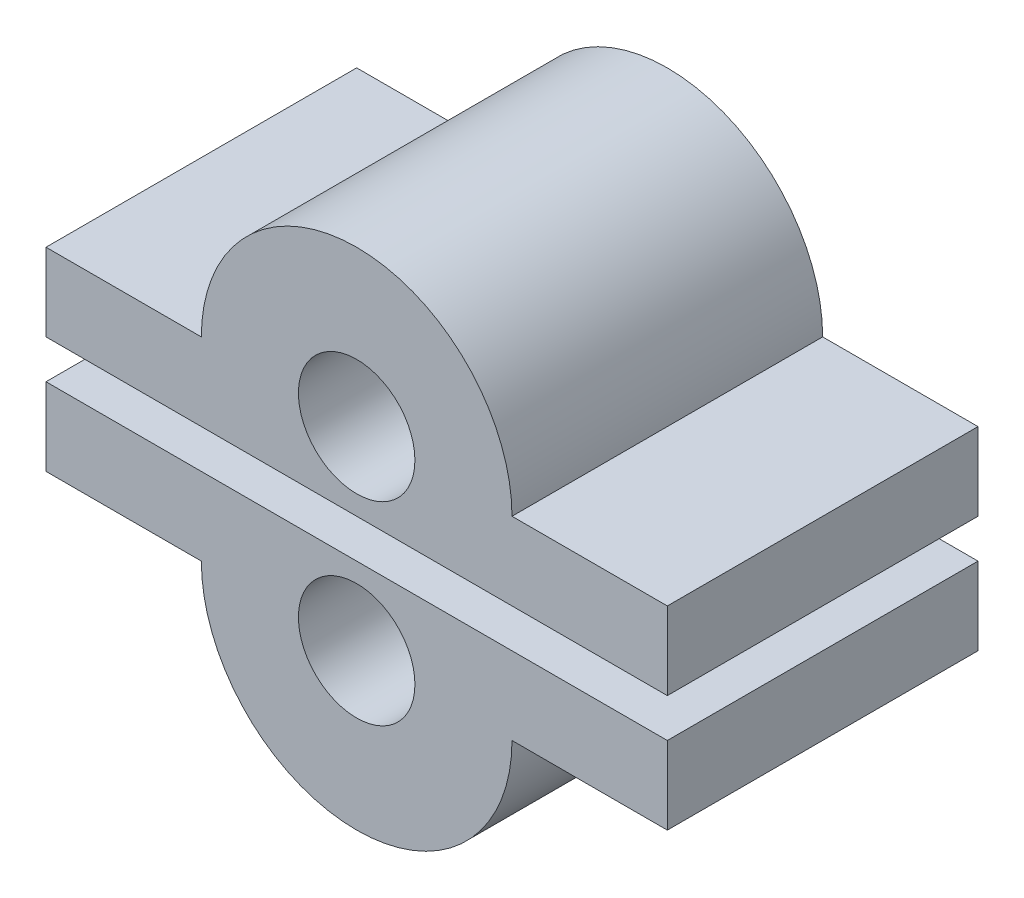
ISO-10303-21;
HEADER;
FILE_DESCRIPTION(('STEP AP214'),'2;1');
FILE_NAME('part.step','',(''),(''),'','','');
FILE_SCHEMA(('AUTOMOTIVE_DESIGN { 1 0 10303 214 1 1 1 1 }'));
ENDSEC;
DATA;
#1=APPLICATION_CONTEXT('core data for automotive mechanical design processes');
#2=APPLICATION_PROTOCOL_DEFINITION('international standard','automotive_design',2000,#1);
#3=PRODUCT_CONTEXT('',#1,'mechanical');
#4=PRODUCT('Part','Part','',(#3));
#5=PRODUCT_RELATED_PRODUCT_CATEGORY('part','',(#4));
#6=PRODUCT_DEFINITION_FORMATION('','',#4);
#7=PRODUCT_DEFINITION_CONTEXT('part definition',#1,'design');
#8=PRODUCT_DEFINITION('design','',#6,#7);
#9=PRODUCT_DEFINITION_SHAPE('','',#8);
#10=(LENGTH_UNIT() NAMED_UNIT(*) SI_UNIT(.MILLI.,.METRE.));
#11=(NAMED_UNIT(*) PLANE_ANGLE_UNIT() SI_UNIT($,.RADIAN.));
#12=(NAMED_UNIT(*) SI_UNIT($,.STERADIAN.) SOLID_ANGLE_UNIT());
#13=UNCERTAINTY_MEASURE_WITH_UNIT(LENGTH_MEASURE(1.E-05),#10,'distance_accuracy_value','');
#14=(GEOMETRIC_REPRESENTATION_CONTEXT(3) GLOBAL_UNCERTAINTY_ASSIGNED_CONTEXT((#13)) GLOBAL_UNIT_ASSIGNED_CONTEXT((#10,
#11,#12)) REPRESENTATION_CONTEXT('',''));
#15=CARTESIAN_POINT('',(0.,0.,0.));
#16=DIRECTION('',(0.,0.,1.));
#17=DIRECTION('',(1.,0.,0.));
#18=AXIS2_PLACEMENT_3D('',#15,#16,#17);
#19=CARTESIAN_POINT('',(40.,12.5,20.));
#20=DIRECTION('',(0.,0.,1.));
#21=DIRECTION('',(1.,0.,0.));
#22=AXIS2_PLACEMENT_3D('',#19,#20,#21);
#23=PLANE('',#22);
#24=DIRECTION('',(1.,0.,0.));
#25=VECTOR('',#24,1.);
#26=CARTESIAN_POINT('',(0.,-2.5,20.));
#27=LINE('',#26,#25);
#28=CARTESIAN_POINT('',(0.,-2.5,20.));
#29=VERTEX_POINT('',#28);
#30=CARTESIAN_POINT('',(80.,-2.5,20.));
#31=VERTEX_POINT('',#30);
#32=EDGE_CURVE('E51',#29,#31,#27,.T.);
#33=ORIENTED_EDGE('',*,*,#32,.F.);
#34=DIRECTION('',(0.,-1.,0.));
#35=VECTOR('',#34,1.);
#36=CARTESIAN_POINT('',(0.,12.5,20.));
#37=LINE('',#36,#35);
#38=CARTESIAN_POINT('',(0.,-12.5,20.));
#39=VERTEX_POINT('',#38);
#40=EDGE_CURVE('E120',#29,#39,#37,.T.);
#41=ORIENTED_EDGE('',*,*,#40,.T.);
#42=DIRECTION('',(1.,0.,0.));
#43=VECTOR('',#42,1.);
#44=CARTESIAN_POINT('',(20.,-12.5,20.));
#45=LINE('',#44,#43);
#46=CARTESIAN_POINT('',(20.,-12.5,20.));
#47=VERTEX_POINT('',#46);
#48=EDGE_CURVE('E121',#39,#47,#45,.T.);
#49=ORIENTED_EDGE('',*,*,#48,.T.);
#50=CARTESIAN_POINT('',(40.,-12.5,20.));
#51=DIRECTION('',(0.,0.,1.));
#52=DIRECTION('',(-1.,0.,0.));
#53=AXIS2_PLACEMENT_3D('',#50,#51,#52);
#54=CIRCLE('',#53,20.);
#55=CARTESIAN_POINT('',(60.,-12.5,20.));
#56=VERTEX_POINT('',#55);
#57=EDGE_CURVE('E116',#47,#56,#54,.T.);
#58=ORIENTED_EDGE('',*,*,#57,.T.);
#59=DIRECTION('',(1.,0.,0.));
#60=VECTOR('',#59,1.);
#61=CARTESIAN_POINT('',(80.,-12.5,20.));
#62=LINE('',#61,#60);
#63=CARTESIAN_POINT('',(80.,-12.5,20.));
#64=VERTEX_POINT('',#63);
#65=EDGE_CURVE('E110',#56,#64,#62,.T.);
#66=ORIENTED_EDGE('',*,*,#65,.T.);
#67=DIRECTION('',(0.,1.,0.));
#68=VECTOR('',#67,1.);
#69=CARTESIAN_POINT('',(80.,-12.5,20.));
#70=LINE('',#69,#68);
#71=EDGE_CURVE('E103',#64,#31,#70,.T.);
#72=ORIENTED_EDGE('',*,*,#71,.T.);
#73=EDGE_LOOP('',(#33,#41,#49,#58,#66,#72));
#74=FACE_BOUND('',#73,.T.);
#75=CARTESIAN_POINT('',(40.,-12.5,20.));
#76=DIRECTION('',(0.,0.,1.));
#77=DIRECTION('',(1.,0.,0.));
#78=AXIS2_PLACEMENT_3D('',#75,#76,#77);
#79=CIRCLE('',#78,7.5);
#80=CARTESIAN_POINT('',(47.5,-12.5,20.));
#81=VERTEX_POINT('',#80);
#82=EDGE_CURVE('E96',#81,#81,#79,.T.);
#83=ORIENTED_EDGE('',*,*,#82,.F.);
#84=EDGE_LOOP('',(#83));
#85=FACE_BOUND('',#84,.T.);
#86=ADVANCED_FACE('F43',(#74,#85),#23,.T.);
#87=CARTESIAN_POINT('',(40.,12.5,-20.));
#88=DIRECTION('',(0.,0.,1.));
#89=DIRECTION('',(1.,0.,0.));
#90=AXIS2_PLACEMENT_3D('',#87,#88,#89);
#91=PLANE('',#90);
#92=CARTESIAN_POINT('',(40.,-12.5,-20.));
#93=DIRECTION('',(0.,0.,1.));
#94=DIRECTION('',(1.,0.,0.));
#95=AXIS2_PLACEMENT_3D('',#92,#93,#94);
#96=CIRCLE('',#95,7.5);
#97=CARTESIAN_POINT('',(47.5,-12.5,-20.));
#98=VERTEX_POINT('',#97);
#99=EDGE_CURVE('E112',#98,#98,#96,.T.);
#100=ORIENTED_EDGE('',*,*,#99,.T.);
#101=EDGE_LOOP('',(#100));
#102=FACE_BOUND('',#101,.T.);
#103=DIRECTION('',(0.,-1.,0.));
#104=VECTOR('',#103,1.);
#105=CARTESIAN_POINT('',(0.,12.5,-20.));
#106=LINE('',#105,#104);
#107=CARTESIAN_POINT('',(0.,-2.5,-20.));
#108=VERTEX_POINT('',#107);
#109=CARTESIAN_POINT('',(0.,-12.5,-20.));
#110=VERTEX_POINT('',#109);
#111=EDGE_CURVE('E46',#108,#110,#106,.T.);
#112=ORIENTED_EDGE('',*,*,#111,.F.);
#113=DIRECTION('',(1.,0.,0.));
#114=VECTOR('',#113,1.);
#115=CARTESIAN_POINT('',(0.,-2.5,-20.));
#116=LINE('',#115,#114);
#117=CARTESIAN_POINT('',(80.,-2.5,-20.));
#118=VERTEX_POINT('',#117);
#119=EDGE_CURVE('E63',#108,#118,#116,.T.);
#120=ORIENTED_EDGE('',*,*,#119,.T.);
#121=DIRECTION('',(0.,1.,0.));
#122=VECTOR('',#121,1.);
#123=CARTESIAN_POINT('',(80.,-12.5,-20.));
#124=LINE('',#123,#122);
#125=CARTESIAN_POINT('',(80.,-12.5,-20.));
#126=VERTEX_POINT('',#125);
#127=EDGE_CURVE('E105',#126,#118,#124,.T.);
#128=ORIENTED_EDGE('',*,*,#127,.F.);
#129=DIRECTION('',(1.,0.,0.));
#130=VECTOR('',#129,1.);
#131=CARTESIAN_POINT('',(80.,-12.5,-20.));
#132=LINE('',#131,#130);
#133=CARTESIAN_POINT('',(60.,-12.5,-20.));
#134=VERTEX_POINT('',#133);
#135=EDGE_CURVE('E137',#134,#126,#132,.T.);
#136=ORIENTED_EDGE('',*,*,#135,.F.);
#137=CARTESIAN_POINT('',(40.,-12.5,-20.));
#138=DIRECTION('',(0.,0.,1.));
#139=DIRECTION('',(-1.,0.,0.));
#140=AXIS2_PLACEMENT_3D('',#137,#138,#139);
#141=CIRCLE('',#140,20.);
#142=CARTESIAN_POINT('',(20.,-12.5,-20.));
#143=VERTEX_POINT('',#142);
#144=EDGE_CURVE('E134',#143,#134,#141,.T.);
#145=ORIENTED_EDGE('',*,*,#144,.F.);
#146=DIRECTION('',(1.,0.,0.));
#147=VECTOR('',#146,1.);
#148=CARTESIAN_POINT('',(20.,-12.5,-20.));
#149=LINE('',#148,#147);
#150=EDGE_CURVE('E131',#110,#143,#149,.T.);
#151=ORIENTED_EDGE('',*,*,#150,.F.);
#152=EDGE_LOOP('',(#112,#120,#128,#136,#145,#151));
#153=FACE_BOUND('',#152,.T.);
#154=ADVANCED_FACE('F152',(#102,#153),#91,.F.);
#155=CARTESIAN_POINT('',(0.,12.5,20.));
#156=DIRECTION('',(1.,0.,0.));
#157=DIRECTION('',(0.,0.,-1.));
#158=AXIS2_PLACEMENT_3D('',#155,#156,#157);
#159=PLANE('',#158);
#160=ORIENTED_EDGE('',*,*,#40,.F.);
#161=DIRECTION('',(0.,0.,1.));
#162=VECTOR('',#161,1.);
#163=CARTESIAN_POINT('',(0.,-2.5,-20.));
#164=LINE('',#163,#162);
#165=EDGE_CURVE('E12',#108,#29,#164,.T.);
#166=ORIENTED_EDGE('',*,*,#165,.F.);
#167=ORIENTED_EDGE('',*,*,#111,.T.);
#168=DIRECTION('',(0.,0.,-1.));
#169=VECTOR('',#168,1.);
#170=CARTESIAN_POINT('',(0.,-12.5,20.));
#171=LINE('',#170,#169);
#172=EDGE_CURVE('E133',#39,#110,#171,.T.);
#173=ORIENTED_EDGE('',*,*,#172,.F.);
#174=EDGE_LOOP('',(#160,#166,#167,#173));
#175=FACE_BOUND('',#174,.T.);
#176=ADVANCED_FACE('F174',(#175),#159,.F.);
#177=CARTESIAN_POINT('',(80.,-12.5,20.));
#178=DIRECTION('',(-1.,0.,0.));
#179=DIRECTION('',(0.,0.,1.));
#180=AXIS2_PLACEMENT_3D('',#177,#178,#179);
#181=PLANE('',#180);
#182=ORIENTED_EDGE('',*,*,#127,.T.);
#183=DIRECTION('',(0.,0.,1.));
#184=VECTOR('',#183,1.);
#185=CARTESIAN_POINT('',(80.,-2.5,-20.));
#186=LINE('',#185,#184);
#187=EDGE_CURVE('E92',#118,#31,#186,.T.);
#188=ORIENTED_EDGE('',*,*,#187,.T.);
#189=ORIENTED_EDGE('',*,*,#71,.F.);
#190=DIRECTION('',(0.,0.,-1.));
#191=VECTOR('',#190,1.);
#192=CARTESIAN_POINT('',(80.,-12.5,20.));
#193=LINE('',#192,#191);
#194=EDGE_CURVE('E106',#64,#126,#193,.T.);
#195=ORIENTED_EDGE('',*,*,#194,.T.);
#196=EDGE_LOOP('',(#182,#188,#189,#195));
#197=FACE_BOUND('',#196,.T.);
#198=ADVANCED_FACE('F101',(#197),#181,.F.);
#199=CARTESIAN_POINT('',(20.,-12.5,20.));
#200=DIRECTION('',(0.,1.,0.));
#201=DIRECTION('',(-1.,0.,0.));
#202=AXIS2_PLACEMENT_3D('',#199,#200,#201);
#203=PLANE('',#202);
#204=ORIENTED_EDGE('',*,*,#150,.T.);
#205=DIRECTION('',(0.,0.,-1.));
#206=VECTOR('',#205,1.);
#207=CARTESIAN_POINT('',(20.,-12.5,20.));
#208=LINE('',#207,#206);
#209=EDGE_CURVE('E136',#47,#143,#208,.T.);
#210=ORIENTED_EDGE('',*,*,#209,.F.);
#211=ORIENTED_EDGE('',*,*,#48,.F.);
#212=ORIENTED_EDGE('',*,*,#172,.T.);
#213=EDGE_LOOP('',(#204,#210,#211,#212));
#214=FACE_BOUND('',#213,.T.);
#215=ADVANCED_FACE('F149',(#214),#203,.F.);
#216=CARTESIAN_POINT('',(40.,-12.5,20.));
#217=DIRECTION('',(0.,0.,-1.));
#218=DIRECTION('',(-1.,0.,0.));
#219=AXIS2_PLACEMENT_3D('',#216,#217,#218);
#220=CYLINDRICAL_SURFACE('',#219,20.);
#221=ORIENTED_EDGE('',*,*,#144,.T.);
#222=DIRECTION('',(0.,0.,-1.));
#223=VECTOR('',#222,1.);
#224=CARTESIAN_POINT('',(60.,-12.5,20.));
#225=LINE('',#224,#223);
#226=EDGE_CURVE('E130',#56,#134,#225,.T.);
#227=ORIENTED_EDGE('',*,*,#226,.F.);
#228=ORIENTED_EDGE('',*,*,#57,.F.);
#229=ORIENTED_EDGE('',*,*,#209,.T.);
#230=EDGE_LOOP('',(#221,#227,#228,#229));
#231=FACE_BOUND('',#230,.T.);
#232=ADVANCED_FACE('F156',(#231),#220,.T.);
#233=CARTESIAN_POINT('',(80.,-12.5,20.));
#234=DIRECTION('',(0.,1.,0.));
#235=DIRECTION('',(0.,0.,1.));
#236=AXIS2_PLACEMENT_3D('',#233,#234,#235);
#237=PLANE('',#236);
#238=ORIENTED_EDGE('',*,*,#135,.T.);
#239=ORIENTED_EDGE('',*,*,#194,.F.);
#240=ORIENTED_EDGE('',*,*,#65,.F.);
#241=ORIENTED_EDGE('',*,*,#226,.T.);
#242=EDGE_LOOP('',(#238,#239,#240,#241));
#243=FACE_BOUND('',#242,.T.);
#244=ADVANCED_FACE('F159',(#243),#237,.F.);
#245=CARTESIAN_POINT('',(40.,-12.5,20.));
#246=DIRECTION('',(0.,0.,-1.));
#247=DIRECTION('',(-1.,0.,0.));
#248=AXIS2_PLACEMENT_3D('',#245,#246,#247);
#249=CYLINDRICAL_SURFACE('',#248,7.5);
#250=ORIENTED_EDGE('',*,*,#82,.T.);
#251=EDGE_LOOP('',(#250));
#252=FACE_BOUND('',#251,.T.);
#253=ORIENTED_EDGE('',*,*,#99,.F.);
#254=EDGE_LOOP('',(#253));
#255=FACE_BOUND('',#254,.T.);
#256=ADVANCED_FACE('F161',(#252,#255),#249,.F.);
#257=CARTESIAN_POINT('',(0.,-2.5,-20.));
#258=DIRECTION('',(0.,-1.,0.));
#259=DIRECTION('',(0.,0.,-1.));
#260=AXIS2_PLACEMENT_3D('',#257,#258,#259);
#261=PLANE('',#260);
#262=ORIENTED_EDGE('',*,*,#32,.T.);
#263=ORIENTED_EDGE('',*,*,#187,.F.);
#264=ORIENTED_EDGE('',*,*,#119,.F.);
#265=ORIENTED_EDGE('',*,*,#165,.T.);
#266=EDGE_LOOP('',(#262,#263,#264,#265));
#267=FACE_BOUND('',#266,.T.);
#268=ADVANCED_FACE('F91',(#267),#261,.F.);
#269=CLOSED_SHELL('',(#86,#154,#176,#198,#215,#232,#244,#256,#268));
#270=MANIFOLD_SOLID_BREP('B2',#269);
#271=CARTESIAN_POINT('',(40.,12.5,20.));
#272=DIRECTION('',(0.,0.,-1.));
#273=DIRECTION('',(-1.,0.,0.));
#274=AXIS2_PLACEMENT_3D('',#271,#272,#273);
#275=CYLINDRICAL_SURFACE('',#274,20.);
#276=CARTESIAN_POINT('',(40.,12.5,-20.));
#277=DIRECTION('',(0.,0.,1.));
#278=DIRECTION('',(1.,0.,0.));
#279=AXIS2_PLACEMENT_3D('',#276,#277,#278);
#280=CIRCLE('',#279,20.);
#281=CARTESIAN_POINT('',(60.,12.5,-20.));
#282=VERTEX_POINT('',#281);
#283=CARTESIAN_POINT('',(20.,12.5,-20.));
#284=VERTEX_POINT('',#283);
#285=EDGE_CURVE('E331',#282,#284,#280,.T.);
#286=ORIENTED_EDGE('',*,*,#285,.T.);
#287=DIRECTION('',(0.,0.,-1.));
#288=VECTOR('',#287,1.);
#289=CARTESIAN_POINT('',(20.,12.5,20.));
#290=LINE('',#289,#288);
#291=CARTESIAN_POINT('',(20.,12.5,20.));
#292=VERTEX_POINT('',#291);
#293=EDGE_CURVE('E248',#292,#284,#290,.T.);
#294=ORIENTED_EDGE('',*,*,#293,.F.);
#295=CARTESIAN_POINT('',(40.,12.5,20.));
#296=DIRECTION('',(0.,0.,1.));
#297=DIRECTION('',(1.,0.,0.));
#298=AXIS2_PLACEMENT_3D('',#295,#296,#297);
#299=CIRCLE('',#298,20.);
#300=CARTESIAN_POINT('',(60.,12.5,20.));
#301=VERTEX_POINT('',#300);
#302=EDGE_CURVE('E344',#301,#292,#299,.T.);
#303=ORIENTED_EDGE('',*,*,#302,.F.);
#304=DIRECTION('',(0.,0.,-1.));
#305=VECTOR('',#304,1.);
#306=CARTESIAN_POINT('',(60.,12.5,20.));
#307=LINE('',#306,#305);
#308=EDGE_CURVE('E41',#301,#282,#307,.T.);
#309=ORIENTED_EDGE('',*,*,#308,.T.);
#310=EDGE_LOOP('',(#286,#294,#303,#309));
#311=FACE_BOUND('',#310,.T.);
#312=ADVANCED_FACE('F240',(#311),#275,.T.);
#313=CARTESIAN_POINT('',(40.,12.5,20.));
#314=DIRECTION('',(0.,0.,-1.));
#315=DIRECTION('',(-1.,0.,0.));
#316=AXIS2_PLACEMENT_3D('',#313,#314,#315);
#317=CYLINDRICAL_SURFACE('',#316,7.5);
#318=CARTESIAN_POINT('',(40.,12.5,20.));
#319=DIRECTION('',(0.,0.,1.));
#320=DIRECTION('',(1.,0.,0.));
#321=AXIS2_PLACEMENT_3D('',#318,#319,#320);
#322=CIRCLE('',#321,7.5);
#323=CARTESIAN_POINT('',(47.5,12.5,20.));
#324=VERTEX_POINT('',#323);
#325=EDGE_CURVE('E350',#324,#324,#322,.T.);
#326=ORIENTED_EDGE('',*,*,#325,.T.);
#327=EDGE_LOOP('',(#326));
#328=FACE_BOUND('',#327,.T.);
#329=CARTESIAN_POINT('',(40.,12.5,-20.));
#330=DIRECTION('',(0.,0.,1.));
#331=DIRECTION('',(1.,0.,0.));
#332=AXIS2_PLACEMENT_3D('',#329,#330,#331);
#333=CIRCLE('',#332,7.5);
#334=CARTESIAN_POINT('',(47.5,12.5,-20.));
#335=VERTEX_POINT('',#334);
#336=EDGE_CURVE('E347',#335,#335,#333,.T.);
#337=ORIENTED_EDGE('',*,*,#336,.F.);
#338=EDGE_LOOP('',(#337));
#339=FACE_BOUND('',#338,.T.);
#340=ADVANCED_FACE('F359',(#328,#339),#317,.F.);
#341=CARTESIAN_POINT('',(20.,12.5,20.));
#342=DIRECTION('',(0.,-1.,0.));
#343=DIRECTION('',(1.,0.,0.));
#344=AXIS2_PLACEMENT_3D('',#341,#342,#343);
#345=PLANE('',#344);
#346=DIRECTION('',(-1.,0.,0.));
#347=VECTOR('',#346,1.);
#348=CARTESIAN_POINT('',(20.,12.5,-20.));
#349=LINE('',#348,#347);
#350=CARTESIAN_POINT('',(0.,12.5,-20.));
#351=VERTEX_POINT('',#350);
#352=EDGE_CURVE('E325',#284,#351,#349,.T.);
#353=ORIENTED_EDGE('',*,*,#352,.T.);
#354=DIRECTION('',(0.,0.,-1.));
#355=VECTOR('',#354,1.);
#356=CARTESIAN_POINT('',(0.,12.5,20.));
#357=LINE('',#356,#355);
#358=CARTESIAN_POINT('',(0.,12.5,20.));
#359=VERTEX_POINT('',#358);
#360=EDGE_CURVE('E311',#359,#351,#357,.T.);
#361=ORIENTED_EDGE('',*,*,#360,.F.);
#362=DIRECTION('',(-1.,0.,0.));
#363=VECTOR('',#362,1.);
#364=CARTESIAN_POINT('',(20.,12.5,20.));
#365=LINE('',#364,#363);
#366=EDGE_CURVE('E313',#292,#359,#365,.T.);
#367=ORIENTED_EDGE('',*,*,#366,.F.);
#368=ORIENTED_EDGE('',*,*,#293,.T.);
#369=EDGE_LOOP('',(#353,#361,#367,#368));
#370=FACE_BOUND('',#369,.T.);
#371=ADVANCED_FACE('F323',(#370),#345,.F.);
#372=CARTESIAN_POINT('',(80.,12.5,20.));
#373=DIRECTION('',(0.,-1.,0.));
#374=DIRECTION('',(0.,0.,-1.));
#375=AXIS2_PLACEMENT_3D('',#372,#373,#374);
#376=PLANE('',#375);
#377=DIRECTION('',(-1.,0.,0.));
#378=VECTOR('',#377,1.);
#379=CARTESIAN_POINT('',(80.,12.5,-20.));
#380=LINE('',#379,#378);
#381=CARTESIAN_POINT('',(80.,12.5,-20.));
#382=VERTEX_POINT('',#381);
#383=EDGE_CURVE('E337',#382,#282,#380,.T.);
#384=ORIENTED_EDGE('',*,*,#383,.T.);
#385=ORIENTED_EDGE('',*,*,#308,.F.);
#386=DIRECTION('',(-1.,0.,0.));
#387=VECTOR('',#386,1.);
#388=CARTESIAN_POINT('',(80.,12.5,20.));
#389=LINE('',#388,#387);
#390=CARTESIAN_POINT('',(80.,12.5,20.));
#391=VERTEX_POINT('',#390);
#392=EDGE_CURVE('E342',#391,#301,#389,.T.);
#393=ORIENTED_EDGE('',*,*,#392,.F.);
#394=DIRECTION('',(0.,0.,-1.));
#395=VECTOR('',#394,1.);
#396=CARTESIAN_POINT('',(80.,12.5,20.));
#397=LINE('',#396,#395);
#398=EDGE_CURVE('E308',#391,#382,#397,.T.);
#399=ORIENTED_EDGE('',*,*,#398,.T.);
#400=EDGE_LOOP('',(#384,#385,#393,#399));
#401=FACE_BOUND('',#400,.T.);
#402=ADVANCED_FACE('F242',(#401),#376,.F.);
#403=CARTESIAN_POINT('',(0.,12.5,20.));
#404=DIRECTION('',(1.,0.,0.));
#405=DIRECTION('',(0.,0.,-1.));
#406=AXIS2_PLACEMENT_3D('',#403,#404,#405);
#407=PLANE('',#406);
#408=DIRECTION('',(0.,-1.,0.));
#409=VECTOR('',#408,1.);
#410=CARTESIAN_POINT('',(0.,12.5,-20.));
#411=LINE('',#410,#409);
#412=CARTESIAN_POINT('',(0.,2.5,-20.));
#413=VERTEX_POINT('',#412);
#414=EDGE_CURVE('E333',#351,#413,#411,.T.);
#415=ORIENTED_EDGE('',*,*,#414,.T.);
#416=DIRECTION('',(0.,0.,1.));
#417=VECTOR('',#416,1.);
#418=CARTESIAN_POINT('',(0.,2.5,-20.));
#419=LINE('',#418,#417);
#420=CARTESIAN_POINT('',(0.,2.5,20.));
#421=VERTEX_POINT('',#420);
#422=EDGE_CURVE('E298',#413,#421,#419,.T.);
#423=ORIENTED_EDGE('',*,*,#422,.T.);
#424=DIRECTION('',(0.,-1.,0.));
#425=VECTOR('',#424,1.);
#426=CARTESIAN_POINT('',(0.,12.5,20.));
#427=LINE('',#426,#425);
#428=EDGE_CURVE('E304',#359,#421,#427,.T.);
#429=ORIENTED_EDGE('',*,*,#428,.F.);
#430=ORIENTED_EDGE('',*,*,#360,.T.);
#431=EDGE_LOOP('',(#415,#423,#429,#430));
#432=FACE_BOUND('',#431,.T.);
#433=ADVANCED_FACE('F346',(#432),#407,.F.);
#434=CARTESIAN_POINT('',(80.,-12.5,20.));
#435=DIRECTION('',(-1.,0.,0.));
#436=DIRECTION('',(0.,0.,1.));
#437=AXIS2_PLACEMENT_3D('',#434,#435,#436);
#438=PLANE('',#437);
#439=DIRECTION('',(0.,1.,0.));
#440=VECTOR('',#439,1.);
#441=CARTESIAN_POINT('',(80.,-12.5,20.));
#442=LINE('',#441,#440);
#443=CARTESIAN_POINT('',(80.,2.5,20.));
#444=VERTEX_POINT('',#443);
#445=EDGE_CURVE('E263',#444,#391,#442,.T.);
#446=ORIENTED_EDGE('',*,*,#445,.F.);
#447=DIRECTION('',(0.,0.,1.));
#448=VECTOR('',#447,1.);
#449=CARTESIAN_POINT('',(80.,2.5,-20.));
#450=LINE('',#449,#448);
#451=CARTESIAN_POINT('',(80.,2.5,-20.));
#452=VERTEX_POINT('',#451);
#453=EDGE_CURVE('E292',#452,#444,#450,.T.);
#454=ORIENTED_EDGE('',*,*,#453,.F.);
#455=DIRECTION('',(0.,1.,0.));
#456=VECTOR('',#455,1.);
#457=CARTESIAN_POINT('',(80.,-12.5,-20.));
#458=LINE('',#457,#456);
#459=EDGE_CURVE('E335',#452,#382,#458,.T.);
#460=ORIENTED_EDGE('',*,*,#459,.T.);
#461=ORIENTED_EDGE('',*,*,#398,.F.);
#462=EDGE_LOOP('',(#446,#454,#460,#461));
#463=FACE_BOUND('',#462,.T.);
#464=ADVANCED_FACE('F306',(#463),#438,.F.);
#465=CARTESIAN_POINT('',(40.,12.5,-20.));
#466=DIRECTION('',(0.,0.,1.));
#467=DIRECTION('',(1.,0.,0.));
#468=AXIS2_PLACEMENT_3D('',#465,#466,#467);
#469=PLANE('',#468);
#470=ORIENTED_EDGE('',*,*,#336,.T.);
#471=EDGE_LOOP('',(#470));
#472=FACE_BOUND('',#471,.T.);
#473=ORIENTED_EDGE('',*,*,#459,.F.);
#474=DIRECTION('',(-1.,0.,0.));
#475=VECTOR('',#474,1.);
#476=CARTESIAN_POINT('',(0.,2.5,-20.));
#477=LINE('',#476,#475);
#478=EDGE_CURVE('E255',#452,#413,#477,.T.);
#479=ORIENTED_EDGE('',*,*,#478,.T.);
#480=ORIENTED_EDGE('',*,*,#414,.F.);
#481=ORIENTED_EDGE('',*,*,#352,.F.);
#482=ORIENTED_EDGE('',*,*,#285,.F.);
#483=ORIENTED_EDGE('',*,*,#383,.F.);
#484=EDGE_LOOP('',(#473,#479,#480,#481,#482,#483));
#485=FACE_BOUND('',#484,.T.);
#486=ADVANCED_FACE('F329',(#472,#485),#469,.F.);
#487=CARTESIAN_POINT('',(40.,12.5,20.));
#488=DIRECTION('',(0.,0.,1.));
#489=DIRECTION('',(1.,0.,0.));
#490=AXIS2_PLACEMENT_3D('',#487,#488,#489);
#491=PLANE('',#490);
#492=DIRECTION('',(-1.,0.,0.));
#493=VECTOR('',#492,1.);
#494=CARTESIAN_POINT('',(0.,2.5,20.));
#495=LINE('',#494,#493);
#496=EDGE_CURVE('E294',#444,#421,#495,.T.);
#497=ORIENTED_EDGE('',*,*,#496,.F.);
#498=ORIENTED_EDGE('',*,*,#445,.T.);
#499=ORIENTED_EDGE('',*,*,#392,.T.);
#500=ORIENTED_EDGE('',*,*,#302,.T.);
#501=ORIENTED_EDGE('',*,*,#366,.T.);
#502=ORIENTED_EDGE('',*,*,#428,.T.);
#503=EDGE_LOOP('',(#497,#498,#499,#500,#501,#502));
#504=FACE_BOUND('',#503,.T.);
#505=ORIENTED_EDGE('',*,*,#325,.F.);
#506=EDGE_LOOP('',(#505));
#507=FACE_BOUND('',#506,.T.);
#508=ADVANCED_FACE('F301',(#504,#507),#491,.T.);
#509=CARTESIAN_POINT('',(0.,2.5,-20.));
#510=DIRECTION('',(0.,1.,0.));
#511=DIRECTION('',(0.,0.,1.));
#512=AXIS2_PLACEMENT_3D('',#509,#510,#511);
#513=PLANE('',#512);
#514=ORIENTED_EDGE('',*,*,#496,.T.);
#515=ORIENTED_EDGE('',*,*,#422,.F.);
#516=ORIENTED_EDGE('',*,*,#478,.F.);
#517=ORIENTED_EDGE('',*,*,#453,.T.);
#518=EDGE_LOOP('',(#514,#515,#516,#517));
#519=FACE_BOUND('',#518,.T.);
#520=ADVANCED_FACE('F293',(#519),#513,.F.);
#521=CLOSED_SHELL('',(#312,#340,#371,#402,#433,#464,#486,#508,#520));
#522=MANIFOLD_SOLID_BREP('B6',#521);
#523=ADVANCED_BREP_SHAPE_REPRESENTATION('',(#18,#270,#522),#14);
#524=SHAPE_DEFINITION_REPRESENTATION(#9,#523);
ENDSEC;
END-ISO-10303-21;
